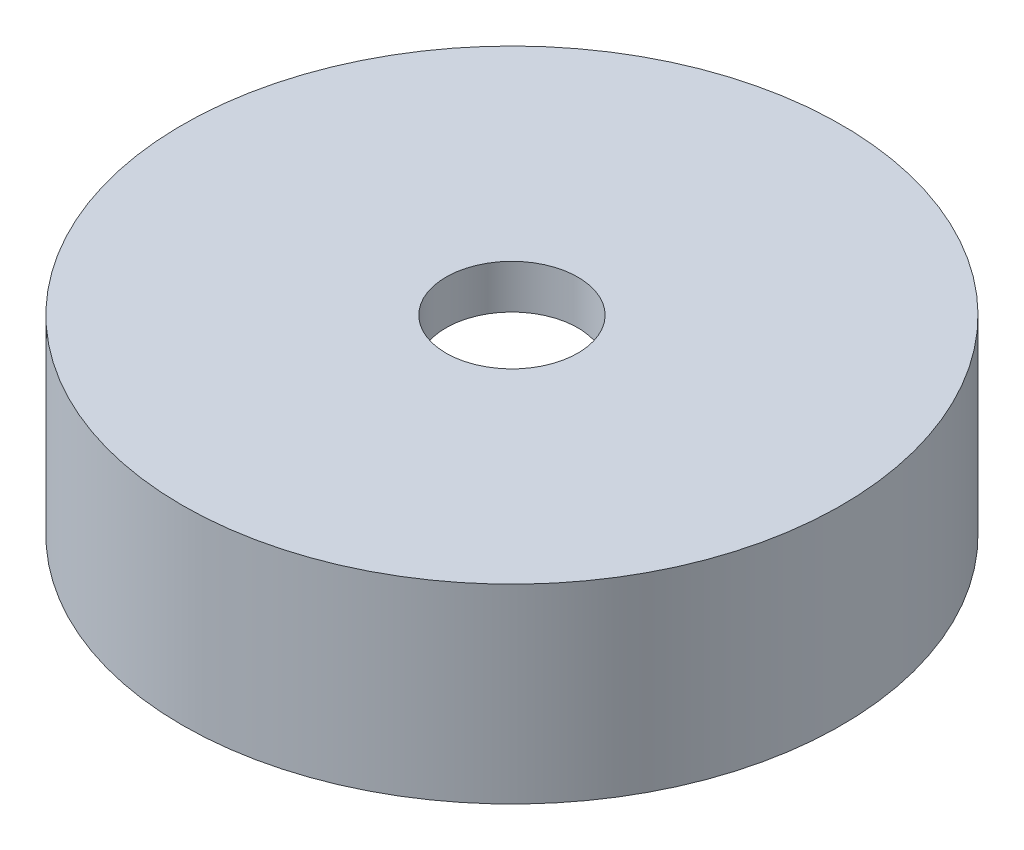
from build123d import *


with BuildPart() as part:
    # Esquisse1 → Base-R_volution (revolve)
    with BuildSketch(Plane.XY, mode=Mode.PRIVATE) as base_r_volution_sk:
        Polygon((4.5, 13), (22.5, 13), (22.5, 0), (19.5, 0), (19.5, 10), (4.5, 10), align=None)
    revolve(base_r_volution_sk.sketch.rotate(Axis((0, 34.184166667, 0), (0, -1, 0)), 90), axis=Axis((0, 34.184166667, 0), (0, -1, 0)))


solid = part.part
